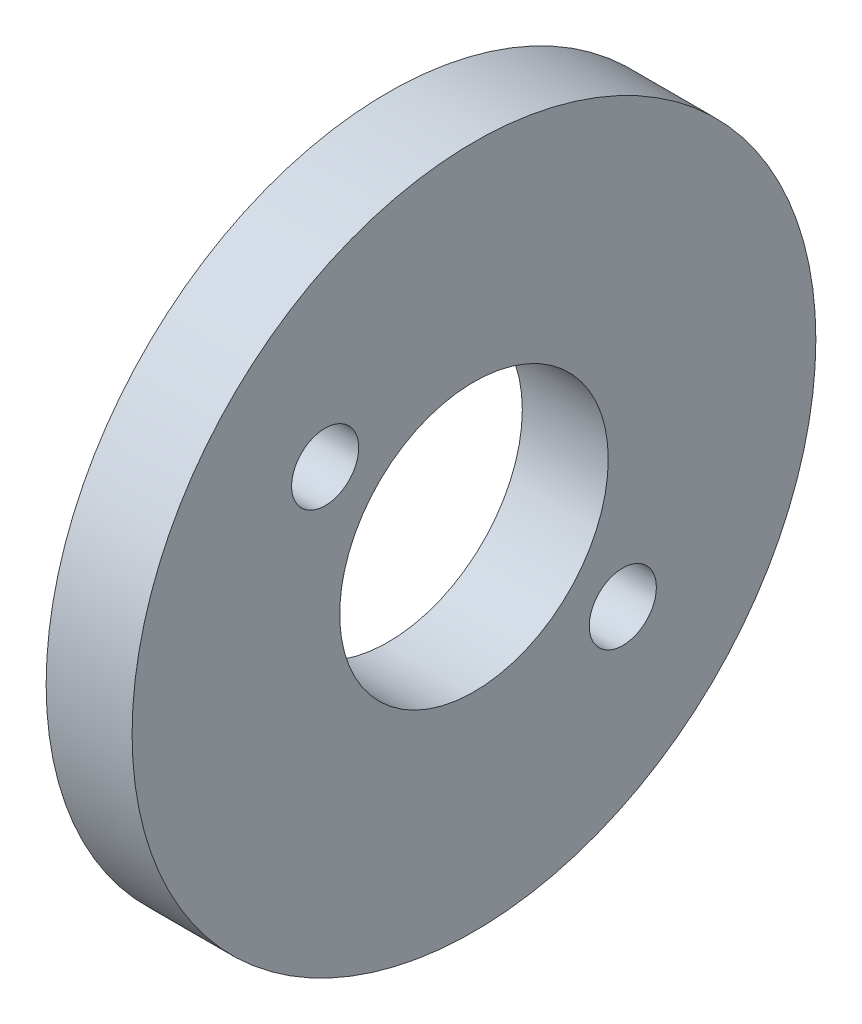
ISO-10303-21;
HEADER;
FILE_DESCRIPTION(('STEP AP214'),'2;1');
FILE_NAME('part.step','',(''),(''),'','','');
FILE_SCHEMA(('AUTOMOTIVE_DESIGN { 1 0 10303 214 1 1 1 1 }'));
ENDSEC;
DATA;
#1=APPLICATION_CONTEXT('core data for automotive mechanical design processes');
#2=APPLICATION_PROTOCOL_DEFINITION('international standard','automotive_design',2000,#1);
#3=PRODUCT_CONTEXT('',#1,'mechanical');
#4=PRODUCT('Part','Part','',(#3));
#5=PRODUCT_RELATED_PRODUCT_CATEGORY('part','',(#4));
#6=PRODUCT_DEFINITION_FORMATION('','',#4);
#7=PRODUCT_DEFINITION_CONTEXT('part definition',#1,'design');
#8=PRODUCT_DEFINITION('design','',#6,#7);
#9=PRODUCT_DEFINITION_SHAPE('','',#8);
#10=(LENGTH_UNIT() NAMED_UNIT(*) SI_UNIT(.MILLI.,.METRE.));
#11=(NAMED_UNIT(*) PLANE_ANGLE_UNIT() SI_UNIT($,.RADIAN.));
#12=(NAMED_UNIT(*) SI_UNIT($,.STERADIAN.) SOLID_ANGLE_UNIT());
#13=UNCERTAINTY_MEASURE_WITH_UNIT(LENGTH_MEASURE(1.E-05),#10,'distance_accuracy_value','');
#14=(GEOMETRIC_REPRESENTATION_CONTEXT(3) GLOBAL_UNCERTAINTY_ASSIGNED_CONTEXT((#13)) GLOBAL_UNIT_ASSIGNED_CONTEXT((#10,
#11,#12)) REPRESENTATION_CONTEXT('',''));
#15=CARTESIAN_POINT('',(0.,0.,0.));
#16=DIRECTION('',(0.,0.,1.));
#17=DIRECTION('',(1.,0.,0.));
#18=AXIS2_PLACEMENT_3D('',#15,#16,#17);
#19=CARTESIAN_POINT('',(-0.508000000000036,6.48826407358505,6.94014821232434));
#20=DIRECTION('',(1.,0.,0.));
#21=DIRECTION('',(0.,0.,-1.));
#22=AXIS2_PLACEMENT_3D('',#19,#20,#21);
#23=PLANE('',#22);
#24=CARTESIAN_POINT('',(-0.508000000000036,6.38135635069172,7.03709395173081));
#25=DIRECTION('',(1.,0.,0.));
#26=DIRECTION('',(0.,0.,-1.));
#27=AXIS2_PLACEMENT_3D('',#24,#25,#26);
#28=CIRCLE('',#27,1.5875);
#29=CARTESIAN_POINT('',(-0.508000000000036,6.38135635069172,5.44959395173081));
#30=VERTEX_POINT('',#29);
#31=EDGE_CURVE('E35',#30,#30,#28,.T.);
#32=ORIENTED_EDGE('',*,*,#31,.T.);
#33=EDGE_LOOP('',(#32));
#34=FACE_BOUND('',#33,.T.);
#35=ADVANCED_FACE('F31',(#34),#23,.T.);
#36=CARTESIAN_POINT('',(-0.508000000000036,-6.4882640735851,-6.94014821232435));
#37=DIRECTION('',(1.,0.,0.));
#38=DIRECTION('',(0.,0.,-1.));
#39=AXIS2_PLACEMENT_3D('',#36,#37,#38);
#40=PLANE('',#39);
#41=CARTESIAN_POINT('',(-0.508000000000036,-6.38135635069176,-7.03709395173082));
#42=DIRECTION('',(1.,0.,0.));
#43=DIRECTION('',(0.,0.,-1.));
#44=AXIS2_PLACEMENT_3D('',#41,#42,#43);
#45=CIRCLE('',#44,1.5875);
#46=CARTESIAN_POINT('',(-0.508000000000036,-6.38135635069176,-8.62459395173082));
#47=VERTEX_POINT('',#46);
#48=EDGE_CURVE('E54',#47,#47,#45,.T.);
#49=ORIENTED_EDGE('',*,*,#48,.T.);
#50=EDGE_LOOP('',(#49));
#51=FACE_BOUND('',#50,.T.);
#52=ADVANCED_FACE('F83',(#51),#40,.T.);
#53=CARTESIAN_POINT('',(-0.508000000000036,6.38135635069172,7.03709395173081));
#54=DIRECTION('',(1.,0.,0.));
#55=DIRECTION('',(0.,0.,-1.));
#56=AXIS2_PLACEMENT_3D('',#53,#54,#55);
#57=CYLINDRICAL_SURFACE('',#56,1.5875);
#58=CARTESIAN_POINT('',(2.03199999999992,6.38135635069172,7.03709395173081));
#59=DIRECTION('',(1.,0.,0.));
#60=DIRECTION('',(0.,0.,-1.));
#61=AXIS2_PLACEMENT_3D('',#58,#59,#60);
#62=CIRCLE('',#61,1.5875);
#63=CARTESIAN_POINT('',(2.03199999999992,6.38135635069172,5.44959395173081));
#64=VERTEX_POINT('',#63);
#65=EDGE_CURVE('E52',#64,#64,#62,.F.);
#66=ORIENTED_EDGE('',*,*,#65,.F.);
#67=EDGE_LOOP('',(#66));
#68=FACE_BOUND('',#67,.T.);
#69=ORIENTED_EDGE('',*,*,#31,.F.);
#70=EDGE_LOOP('',(#69));
#71=FACE_BOUND('',#70,.T.);
#72=ADVANCED_FACE('F79',(#68,#71),#57,.F.);
#73=CARTESIAN_POINT('',(-0.508000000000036,-6.38135635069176,-7.03709395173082));
#74=DIRECTION('',(1.,0.,0.));
#75=DIRECTION('',(0.,0.,-1.));
#76=AXIS2_PLACEMENT_3D('',#73,#74,#75);
#77=CYLINDRICAL_SURFACE('',#76,1.5875);
#78=CARTESIAN_POINT('',(2.03199999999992,-6.38135635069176,-7.03709395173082));
#79=DIRECTION('',(1.,0.,0.));
#80=DIRECTION('',(0.,0.,-1.));
#81=AXIS2_PLACEMENT_3D('',#78,#79,#80);
#82=CIRCLE('',#81,1.5875);
#83=CARTESIAN_POINT('',(2.03199999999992,-6.38135635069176,-8.62459395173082));
#84=VERTEX_POINT('',#83);
#85=EDGE_CURVE('E44',#84,#84,#82,.F.);
#86=ORIENTED_EDGE('',*,*,#85,.F.);
#87=EDGE_LOOP('',(#86));
#88=FACE_BOUND('',#87,.T.);
#89=ORIENTED_EDGE('',*,*,#48,.F.);
#90=EDGE_LOOP('',(#89));
#91=FACE_BOUND('',#90,.T.);
#92=ADVANCED_FACE('F82',(#88,#91),#77,.F.);
#93=CARTESIAN_POINT('',(-2.03199999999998,1.46973636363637,0.));
#94=DIRECTION('',(1.,0.,0.));
#95=DIRECTION('',(0.,0.,-1.));
#96=AXIS2_PLACEMENT_3D('',#93,#94,#95);
#97=PLANE('',#96);
#98=CARTESIAN_POINT('',(-2.03199999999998,0.,0.));
#99=DIRECTION('',(1.,0.,0.));
#100=DIRECTION('',(0.,0.,-1.));
#101=AXIS2_PLACEMENT_3D('',#98,#99,#100);
#102=CIRCLE('',#101,6.35);
#103=CARTESIAN_POINT('',(-2.03199999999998,0.,-6.35));
#104=VERTEX_POINT('',#103);
#105=EDGE_CURVE('E59',#104,#104,#102,.T.);
#106=ORIENTED_EDGE('',*,*,#105,.T.);
#107=EDGE_LOOP('',(#106));
#108=FACE_BOUND('',#107,.T.);
#109=CARTESIAN_POINT('',(-2.03199999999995,0.,0.));
#110=DIRECTION('',(1.,0.,0.));
#111=DIRECTION('',(0.,0.,-1.));
#112=AXIS2_PLACEMENT_3D('',#109,#110,#111);
#113=CIRCLE('',#112,16.1671);
#114=CARTESIAN_POINT('',(-2.03199999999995,0.,-16.1671));
#115=VERTEX_POINT('',#114);
#116=EDGE_CURVE('E39',#115,#115,#113,.T.);
#117=ORIENTED_EDGE('',*,*,#116,.F.);
#118=EDGE_LOOP('',(#117));
#119=FACE_BOUND('',#118,.T.);
#120=ADVANCED_FACE('F73',(#108,#119),#97,.F.);
#121=CARTESIAN_POINT('',(2.03199999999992,1.46973636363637,0.));
#122=DIRECTION('',(1.,0.,0.));
#123=DIRECTION('',(0.,0.,-1.));
#124=AXIS2_PLACEMENT_3D('',#121,#122,#123);
#125=PLANE('',#124);
#126=CARTESIAN_POINT('',(2.03199999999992,0.,0.));
#127=DIRECTION('',(1.,0.,0.));
#128=DIRECTION('',(0.,0.,-1.));
#129=AXIS2_PLACEMENT_3D('',#126,#127,#128);
#130=CIRCLE('',#129,6.35);
#131=CARTESIAN_POINT('',(2.03199999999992,0.,-6.35));
#132=VERTEX_POINT('',#131);
#133=EDGE_CURVE('E47',#132,#132,#130,.T.);
#134=ORIENTED_EDGE('',*,*,#133,.F.);
#135=EDGE_LOOP('',(#134));
#136=FACE_BOUND('',#135,.T.);
#137=ORIENTED_EDGE('',*,*,#85,.T.);
#138=EDGE_LOOP('',(#137));
#139=FACE_BOUND('',#138,.T.);
#140=ORIENTED_EDGE('',*,*,#65,.T.);
#141=EDGE_LOOP('',(#140));
#142=FACE_BOUND('',#141,.T.);
#143=CARTESIAN_POINT('',(2.03199999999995,0.,0.));
#144=DIRECTION('',(1.,0.,0.));
#145=DIRECTION('',(0.,0.,-1.));
#146=AXIS2_PLACEMENT_3D('',#143,#144,#145);
#147=CIRCLE('',#146,16.1671);
#148=CARTESIAN_POINT('',(2.03199999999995,0.,-16.1671));
#149=VERTEX_POINT('',#148);
#150=EDGE_CURVE('E10',#149,#149,#147,.F.);
#151=ORIENTED_EDGE('',*,*,#150,.F.);
#152=EDGE_LOOP('',(#151));
#153=FACE_BOUND('',#152,.T.);
#154=ADVANCED_FACE('F70',(#136,#139,#142,#153),#125,.T.);
#155=CARTESIAN_POINT('',(-2.03199999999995,0.,0.));
#156=DIRECTION('',(1.,0.,0.));
#157=DIRECTION('',(0.,0.,-1.));
#158=AXIS2_PLACEMENT_3D('',#155,#156,#157);
#159=CYLINDRICAL_SURFACE('',#158,16.1671);
#160=ORIENTED_EDGE('',*,*,#116,.T.);
#161=EDGE_LOOP('',(#160));
#162=FACE_BOUND('',#161,.T.);
#163=ORIENTED_EDGE('',*,*,#150,.T.);
#164=EDGE_LOOP('',(#163));
#165=FACE_BOUND('',#164,.T.);
#166=ADVANCED_FACE('F33',(#162,#165),#159,.T.);
#167=CARTESIAN_POINT('',(-2.03199999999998,0.,0.));
#168=DIRECTION('',(1.,0.,0.));
#169=DIRECTION('',(0.,0.,-1.));
#170=AXIS2_PLACEMENT_3D('',#167,#168,#169);
#171=CYLINDRICAL_SURFACE('',#170,6.35);
#172=ORIENTED_EDGE('',*,*,#105,.F.);
#173=EDGE_LOOP('',(#172));
#174=FACE_BOUND('',#173,.T.);
#175=ORIENTED_EDGE('',*,*,#133,.T.);
#176=EDGE_LOOP('',(#175));
#177=FACE_BOUND('',#176,.T.);
#178=ADVANCED_FACE('F68',(#174,#177),#171,.F.);
#179=CLOSED_SHELL('',(#35,#52,#72,#92,#120,#154,#166,#178));
#180=MANIFOLD_SOLID_BREP('B2',#179);
#181=ADVANCED_BREP_SHAPE_REPRESENTATION('',(#18,#180),#14);
#182=SHAPE_DEFINITION_REPRESENTATION(#9,#181);
ENDSEC;
END-ISO-10303-21;
